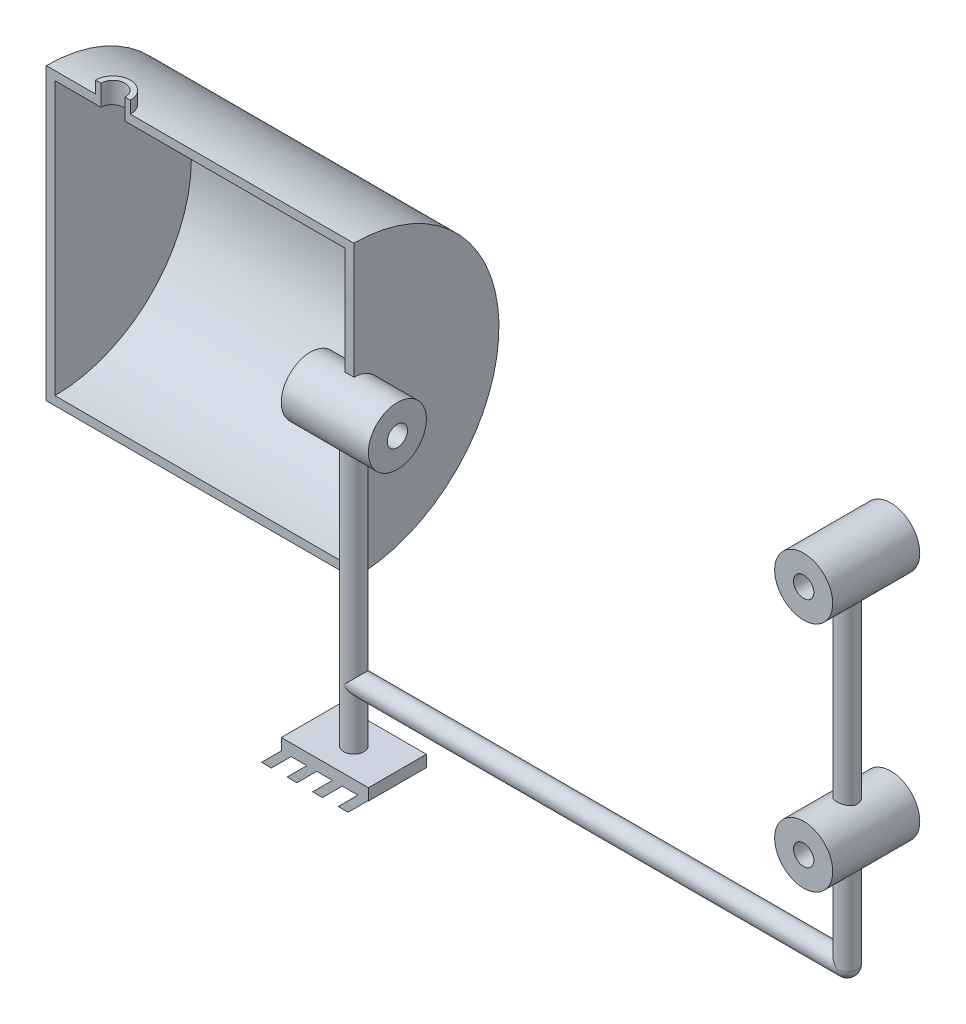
from build123d import *

# Parameters (mm, degrees)
EXTRUSION1_DEPTH        = 15
EXTRUSION1_DEPTH_BACK   = 15
ESQUISSE2_R             = 10
ESQUISSE2_R_2           = 3.5
R_VOLUTION1_ANGLE       = 180
ESQUISSE4_W             = 6
ESQUISSE4_H             = 7.173047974
ENL_V_MAT_EXTRU_1_DEPTH = 15
ESQUISSE6_R             = 3.5
EXTRUSION2_DEPTH        = 100
ESQUISSE7_R             = 3.5
EXTRUSION3_DEPTH        = 170
ESQUISSE8_W             = 3.5
ESQUISSE8_H             = 120
EXTRUSION6_DEPTH        = 15
EXTRUSION6_DEPTH_BACK   = 15
ESQUISSE10_R            = 10
ESQUISSE12_R            = 3.5
ENL_V_MAT_EXTRU_2_DEPTH = 43
ENL_V_START             = -43
ESQUISSE13_R            = 3.5
ENL_V_MAT_EXTRU_3_DEPTH = 43
ESQUISSE14_W            = 30
ESQUISSE14_H            = 20
EXTRUSION7_DEPTH        = 4
EXTRUSION8_DEPTH        = 20


with BuildPart() as part:
    # Esquisse2 → Extrusion1 (new, two sides: drawn at the far end of the back side and taken through both)
    with BuildSketch(Plane(origin=(0, 0, 0), x_dir=(0, 0, -1), z_dir=(1, 0, 0)).offset(-EXTRUSION1_DEPTH_BACK)):
        Circle(ESQUISSE2_R)
        Circle(ESQUISSE2_R_2, mode=Mode.SUBTRACT)
    extrude(amount=EXTRUSION1_DEPTH + EXTRUSION1_DEPTH_BACK)

    # Esquisse3 → R_volution1 (revolve)
    with BuildSketch(Plane.XY):
        Polygon((-106, 0), (-106, 50), (0, 50), (0, 10), (-3, 10), (-3, 47), (-103, 47), (-103, 0), align=None)
    revolve(axis=Axis((0, 0, 0), (-1, 0, 0)), revolution_arc=R_VOLUTION1_ANGLE)

    # Esquisse4 → R_volution2 (revolve)
    with BuildSketch(Plane.XY, mode=Mode.PRIVATE) as r_volution2_sk:
        with Locations((-86, 50.586523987)):
            Rectangle(ESQUISSE4_W, ESQUISSE4_H)
    revolve(r_volution2_sk.sketch.rotate(Axis((-83, 60.808674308, 0), (0, -1, 0)), 270), axis=Axis((-83, 60.808674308, 0), (0, -1, 0)))

    # Esquisse5 → Enl_v. mat.-Extru.1 (cut)
    with BuildSketch(Plane(origin=(0, 54.173047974, 0), x_dir=(-1, 0, 0), z_dir=(0, 1, 0))):
        with BuildLine():
            Line((67.697447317, 0), (78.855384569, 0))
            ThreePointArc((78.855384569, 0), (83, -4.144615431), (87.144615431, 0))
            Line((87.144615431, 0), (94.898943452, 0))
            Line((94.898943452, 0), (94.898943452, 18.492683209))
            Line((94.898943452, 18.492683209), (67.697447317, 18.492683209))
            Line((67.697447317, 18.492683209), (67.697447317, 0))
        make_face()
    extrude(amount=-ENL_V_MAT_EXTRU_1_DEPTH, mode=Mode.SUBTRACT)

    # Esquisse6 → Extrusion2 (add)
    with BuildSketch(Plane(origin=(0, 0, 0), x_dir=(1, 0, 0), z_dir=(0, 1, 0))):
        with Locations(Location((0, 0, 0), (0, 0, 270))):
            Circle(ESQUISSE6_R)
    extrude(amount=-EXTRUSION2_DEPTH)

    # Esquisse7 → Extrusion3 (add)
    with BuildSketch(Plane(origin=(0, 0, 0), x_dir=(0, 0, -1), z_dir=(1, 0, 0))):
        with Locations((0, -80)):
            Circle(ESQUISSE7_R)
    extrude(amount=EXTRUSION3_DEPTH)

    # Esquisse8 → R_volution3 (revolve)
    with BuildSketch(Plane.XY, mode=Mode.PRIVATE) as r_volution3_sk:
        with Locations((171.75, -20)):
            Rectangle(ESQUISSE8_W, ESQUISSE8_H)
    revolve(r_volution3_sk.sketch.rotate(Axis((170, -83.5, 0), (0, 1, 0)), 90), axis=Axis((170, -83.5, 0), (0, 1, 0)))

    # Esquisse10 → Extrusion6 (add, two sides: drawn at the far end of the back side and taken through both)
    with BuildSketch(Plane.XY.offset(-EXTRUSION6_DEPTH_BACK)):
        with Locations((170, 40)):
            Circle(ESQUISSE10_R)
        with Locations((170, -40)):
            Circle(ESQUISSE10_R)
    extrude(amount=EXTRUSION6_DEPTH + EXTRUSION6_DEPTH_BACK)

    # Esquisse12 → Enl_v. mat.-Extru.2 (cut)
    with BuildSketch(Plane.XY.offset(15)):
        with Locations((170, -40)):
            Circle(ESQUISSE12_R)
        with Locations((170, 40)):
            Circle(ESQUISSE12_R)
    extrude(amount=-ENL_V_MAT_EXTRU_2_DEPTH, mode=Mode.SUBTRACT)

    # Esquisse13 → Enl_v. mat.-Extru.3 (cut)
    with BuildSketch(Plane(origin=(15, 0, 0), x_dir=(0, 0, -1), z_dir=(1, 0, 0)).offset(ENL_V_START)):
        Circle(ESQUISSE13_R)
    extrude(amount=ENL_V_MAT_EXTRU_3_DEPTH, mode=Mode.SUBTRACT)

    # Esquisse14 → Extrusion7 (add)
    with BuildSketch(Plane.XZ.offset(100)):
        Rectangle(ESQUISSE14_W, ESQUISSE14_H)
    extrude(amount=EXTRUSION7_DEPTH)

    # Esquisse15 → Extrusion8 (add)
    with BuildSketch(Plane.XY.offset(10)):
        Polygon((-15, -104), (-21.811396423, -110.811396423), (-18.405698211, -110.811396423), (-11.594301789, -104), align=None)
        Polygon((-2.794301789, -104), (-6.2, -104), (-13.011396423, -110.811396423), (-9.605698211, -110.811396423), align=None)
        Polygon((6.005698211, -104), (2.6, -104), (-4.211396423, -110.811396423), (-0.805698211, -110.811396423), align=None)
        Polygon((14.805698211, -104), (11.4, -104), (4.588603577, -110.811396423), (7.994301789, -110.811396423), align=None)
    extrude(amount=-EXTRUSION8_DEPTH)

    # Esquisse16 → R_volution4 (revolve)
    with BuildSketch(Plane(origin=(170, 0, 0), x_dir=(0, 0, -1), z_dir=(1, 0, 0))):
        with BuildLine():
            Line((3.5, -80), (-3.5, -80))
            ThreePointArc((-3.5, -80), (0, -83.5), (3.5, -80))
        make_face()
    revolve(axis=Axis((170, -80, 10.643095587), (0, 0, -1)))


solid = part.part
